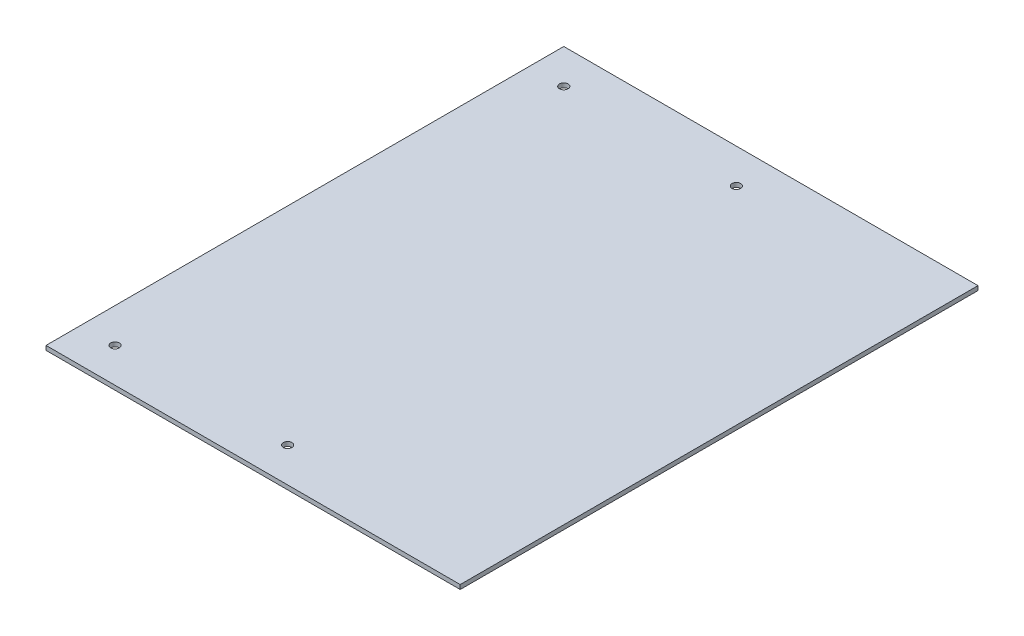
ISO-10303-21;
HEADER;
FILE_DESCRIPTION(('STEP AP214'),'2;1');
FILE_NAME('part.step','',(''),(''),'','','');
FILE_SCHEMA(('AUTOMOTIVE_DESIGN { 1 0 10303 214 1 1 1 1 }'));
ENDSEC;
DATA;
#1=APPLICATION_CONTEXT('core data for automotive mechanical design processes');
#2=APPLICATION_PROTOCOL_DEFINITION('international standard','automotive_design',2000,#1);
#3=PRODUCT_CONTEXT('',#1,'mechanical');
#4=PRODUCT('Part','Part','',(#3));
#5=PRODUCT_RELATED_PRODUCT_CATEGORY('part','',(#4));
#6=PRODUCT_DEFINITION_FORMATION('','',#4);
#7=PRODUCT_DEFINITION_CONTEXT('part definition',#1,'design');
#8=PRODUCT_DEFINITION('design','',#6,#7);
#9=PRODUCT_DEFINITION_SHAPE('','',#8);
#10=(LENGTH_UNIT() NAMED_UNIT(*) SI_UNIT(.MILLI.,.METRE.));
#11=(NAMED_UNIT(*) PLANE_ANGLE_UNIT() SI_UNIT($,.RADIAN.));
#12=(NAMED_UNIT(*) SI_UNIT($,.STERADIAN.) SOLID_ANGLE_UNIT());
#13=UNCERTAINTY_MEASURE_WITH_UNIT(LENGTH_MEASURE(1.E-05),#10,'distance_accuracy_value','');
#14=(GEOMETRIC_REPRESENTATION_CONTEXT(3) GLOBAL_UNCERTAINTY_ASSIGNED_CONTEXT((#13)) GLOBAL_UNIT_ASSIGNED_CONTEXT((#10,
#11,#12)) REPRESENTATION_CONTEXT('',''));
#15=CARTESIAN_POINT('',(0.,0.,0.));
#16=DIRECTION('',(0.,0.,1.));
#17=DIRECTION('',(1.,0.,0.));
#18=AXIS2_PLACEMENT_3D('',#15,#16,#17);
#19=CARTESIAN_POINT('',(0.,1.5875,0.));
#20=DIRECTION('',(0.,1.,0.));
#21=DIRECTION('',(0.,0.,1.));
#22=AXIS2_PLACEMENT_3D('',#19,#20,#21);
#23=PLANE('',#22);
#24=CARTESIAN_POINT('',(0.,1.5875,-82.55));
#25=DIRECTION('',(0.,1.,0.));
#26=DIRECTION('',(0.,0.,-1.));
#27=AXIS2_PLACEMENT_3D('',#24,#25,#26);
#28=CIRCLE('',#27,1.5875);
#29=CARTESIAN_POINT('',(0.,1.5875,-84.1375));
#30=VERTEX_POINT('',#29);
#31=EDGE_CURVE('E121',#30,#30,#28,.T.);
#32=ORIENTED_EDGE('',*,*,#31,.F.);
#33=EDGE_LOOP('',(#32));
#34=FACE_BOUND('',#33,.T.);
#35=CARTESIAN_POINT('',(-63.5,1.5875,82.55));
#36=DIRECTION('',(0.,1.,0.));
#37=DIRECTION('',(0.,0.,1.));
#38=AXIS2_PLACEMENT_3D('',#35,#36,#37);
#39=CIRCLE('',#38,1.5875);
#40=CARTESIAN_POINT('',(-63.5,1.5875,84.1375));
#41=VERTEX_POINT('',#40);
#42=EDGE_CURVE('E100',#41,#41,#39,.T.);
#43=ORIENTED_EDGE('',*,*,#42,.F.);
#44=EDGE_LOOP('',(#43));
#45=FACE_BOUND('',#44,.T.);
#46=DIRECTION('',(0.,0.,1.));
#47=VECTOR('',#46,1.);
#48=CARTESIAN_POINT('',(-76.2,1.5875,95.25));
#49=LINE('',#48,#47);
#50=CARTESIAN_POINT('',(-76.2,1.5875,-95.25));
#51=VERTEX_POINT('',#50);
#52=CARTESIAN_POINT('',(-76.2,1.5875,95.25));
#53=VERTEX_POINT('',#52);
#54=EDGE_CURVE('E85',#51,#53,#49,.T.);
#55=ORIENTED_EDGE('',*,*,#54,.T.);
#56=DIRECTION('',(1.,0.,0.));
#57=VECTOR('',#56,1.);
#58=CARTESIAN_POINT('',(76.2,1.5875,95.25));
#59=LINE('',#58,#57);
#60=CARTESIAN_POINT('',(76.2,1.5875,95.25));
#61=VERTEX_POINT('',#60);
#62=EDGE_CURVE('E80',#53,#61,#59,.T.);
#63=ORIENTED_EDGE('',*,*,#62,.T.);
#64=DIRECTION('',(0.,0.,-1.));
#65=VECTOR('',#64,1.);
#66=CARTESIAN_POINT('',(76.2,1.5875,95.25));
#67=LINE('',#66,#65);
#68=CARTESIAN_POINT('',(76.2,1.5875,-95.25));
#69=VERTEX_POINT('',#68);
#70=EDGE_CURVE('E83',#61,#69,#67,.T.);
#71=ORIENTED_EDGE('',*,*,#70,.T.);
#72=DIRECTION('',(-1.,0.,0.));
#73=VECTOR('',#72,1.);
#74=CARTESIAN_POINT('',(76.2,1.5875,-95.25));
#75=LINE('',#74,#73);
#76=EDGE_CURVE('E50',#69,#51,#75,.T.);
#77=ORIENTED_EDGE('',*,*,#76,.T.);
#78=EDGE_LOOP('',(#55,#63,#71,#77));
#79=FACE_BOUND('',#78,.T.);
#80=CARTESIAN_POINT('',(0.,1.5875,82.55));
#81=DIRECTION('',(0.,1.,0.));
#82=DIRECTION('',(0.,0.,1.));
#83=AXIS2_PLACEMENT_3D('',#80,#81,#82);
#84=CIRCLE('',#83,1.5875);
#85=CARTESIAN_POINT('',(0.,1.5875,84.1375));
#86=VERTEX_POINT('',#85);
#87=EDGE_CURVE('E115',#86,#86,#84,.T.);
#88=ORIENTED_EDGE('',*,*,#87,.F.);
#89=EDGE_LOOP('',(#88));
#90=FACE_BOUND('',#89,.T.);
#91=CARTESIAN_POINT('',(-63.5,1.5875,-82.55));
#92=DIRECTION('',(0.,1.,0.));
#93=DIRECTION('',(0.,0.,-1.));
#94=AXIS2_PLACEMENT_3D('',#91,#92,#93);
#95=CIRCLE('',#94,1.5875);
#96=CARTESIAN_POINT('',(-63.5,1.5875,-84.1374999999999));
#97=VERTEX_POINT('',#96);
#98=EDGE_CURVE('E127',#97,#97,#95,.T.);
#99=ORIENTED_EDGE('',*,*,#98,.F.);
#100=EDGE_LOOP('',(#99));
#101=FACE_BOUND('',#100,.T.);
#102=ADVANCED_FACE('F33',(#34,#45,#79,#90,#101),#23,.T.);
#103=CARTESIAN_POINT('',(0.,0.,0.));
#104=DIRECTION('',(0.,1.,0.));
#105=DIRECTION('',(0.,0.,1.));
#106=AXIS2_PLACEMENT_3D('',#103,#104,#105);
#107=PLANE('',#106);
#108=DIRECTION('',(0.,0.,1.));
#109=VECTOR('',#108,1.);
#110=CARTESIAN_POINT('',(-76.2,0.,95.25));
#111=LINE('',#110,#109);
#112=CARTESIAN_POINT('',(-76.2,0.,-95.25));
#113=VERTEX_POINT('',#112);
#114=CARTESIAN_POINT('',(-76.2,0.,95.25));
#115=VERTEX_POINT('',#114);
#116=EDGE_CURVE('E97',#113,#115,#111,.T.);
#117=ORIENTED_EDGE('',*,*,#116,.F.);
#118=DIRECTION('',(-1.,0.,0.));
#119=VECTOR('',#118,1.);
#120=CARTESIAN_POINT('',(76.2,0.,-95.25));
#121=LINE('',#120,#119);
#122=CARTESIAN_POINT('',(76.2,0.,-95.25));
#123=VERTEX_POINT('',#122);
#124=EDGE_CURVE('E73',#123,#113,#121,.T.);
#125=ORIENTED_EDGE('',*,*,#124,.F.);
#126=DIRECTION('',(0.,0.,-1.));
#127=VECTOR('',#126,1.);
#128=CARTESIAN_POINT('',(76.2,0.,95.25));
#129=LINE('',#128,#127);
#130=CARTESIAN_POINT('',(76.2,0.,95.25));
#131=VERTEX_POINT('',#130);
#132=EDGE_CURVE('E67',#131,#123,#129,.T.);
#133=ORIENTED_EDGE('',*,*,#132,.F.);
#134=DIRECTION('',(1.,0.,0.));
#135=VECTOR('',#134,1.);
#136=CARTESIAN_POINT('',(76.2,0.,95.25));
#137=LINE('',#136,#135);
#138=EDGE_CURVE('E89',#115,#131,#137,.T.);
#139=ORIENTED_EDGE('',*,*,#138,.F.);
#140=EDGE_LOOP('',(#117,#125,#133,#139));
#141=FACE_BOUND('',#140,.T.);
#142=CARTESIAN_POINT('',(-63.5,0.,82.55));
#143=DIRECTION('',(0.,1.,0.));
#144=DIRECTION('',(0.,0.,1.));
#145=AXIS2_PLACEMENT_3D('',#142,#143,#144);
#146=CIRCLE('',#145,1.5875);
#147=CARTESIAN_POINT('',(-63.5,0.,84.1375));
#148=VERTEX_POINT('',#147);
#149=EDGE_CURVE('E112',#148,#148,#146,.T.);
#150=ORIENTED_EDGE('',*,*,#149,.T.);
#151=EDGE_LOOP('',(#150));
#152=FACE_BOUND('',#151,.T.);
#153=CARTESIAN_POINT('',(0.,0.,82.55));
#154=DIRECTION('',(0.,1.,0.));
#155=DIRECTION('',(0.,0.,1.));
#156=AXIS2_PLACEMENT_3D('',#153,#154,#155);
#157=CIRCLE('',#156,1.5875);
#158=CARTESIAN_POINT('',(0.,0.,84.1375));
#159=VERTEX_POINT('',#158);
#160=EDGE_CURVE('E118',#159,#159,#157,.T.);
#161=ORIENTED_EDGE('',*,*,#160,.T.);
#162=EDGE_LOOP('',(#161));
#163=FACE_BOUND('',#162,.T.);
#164=CARTESIAN_POINT('',(0.,0.,-82.55));
#165=DIRECTION('',(0.,1.,0.));
#166=DIRECTION('',(0.,0.,-1.));
#167=AXIS2_PLACEMENT_3D('',#164,#165,#166);
#168=CIRCLE('',#167,1.5875);
#169=CARTESIAN_POINT('',(0.,0.,-84.1375));
#170=VERTEX_POINT('',#169);
#171=EDGE_CURVE('E124',#170,#170,#168,.T.);
#172=ORIENTED_EDGE('',*,*,#171,.T.);
#173=EDGE_LOOP('',(#172));
#174=FACE_BOUND('',#173,.T.);
#175=CARTESIAN_POINT('',(-63.5,0.,-82.55));
#176=DIRECTION('',(0.,1.,0.));
#177=DIRECTION('',(0.,0.,-1.));
#178=AXIS2_PLACEMENT_3D('',#175,#176,#177);
#179=CIRCLE('',#178,1.5875);
#180=CARTESIAN_POINT('',(-63.5,0.,-84.1374999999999));
#181=VERTEX_POINT('',#180);
#182=EDGE_CURVE('E130',#181,#181,#179,.T.);
#183=ORIENTED_EDGE('',*,*,#182,.T.);
#184=EDGE_LOOP('',(#183));
#185=FACE_BOUND('',#184,.T.);
#186=ADVANCED_FACE('F108',(#141,#152,#163,#174,#185),#107,.F.);
#187=CARTESIAN_POINT('',(-76.2,1.5875,95.25));
#188=DIRECTION('',(1.,0.,0.));
#189=DIRECTION('',(0.,0.,-1.));
#190=AXIS2_PLACEMENT_3D('',#187,#188,#189);
#191=PLANE('',#190);
#192=ORIENTED_EDGE('',*,*,#116,.T.);
#193=DIRECTION('',(0.,-1.,0.));
#194=VECTOR('',#193,1.);
#195=CARTESIAN_POINT('',(-76.2,1.5875,95.25));
#196=LINE('',#195,#194);
#197=EDGE_CURVE('E11',#53,#115,#196,.T.);
#198=ORIENTED_EDGE('',*,*,#197,.F.);
#199=ORIENTED_EDGE('',*,*,#54,.F.);
#200=DIRECTION('',(0.,-1.,0.));
#201=VECTOR('',#200,1.);
#202=CARTESIAN_POINT('',(-76.2,1.5875,-95.25));
#203=LINE('',#202,#201);
#204=EDGE_CURVE('E93',#51,#113,#203,.T.);
#205=ORIENTED_EDGE('',*,*,#204,.T.);
#206=EDGE_LOOP('',(#192,#198,#199,#205));
#207=FACE_BOUND('',#206,.T.);
#208=ADVANCED_FACE('F35',(#207),#191,.F.);
#209=CARTESIAN_POINT('',(76.2,1.5875,95.25));
#210=DIRECTION('',(0.,0.,-1.));
#211=DIRECTION('',(-1.,0.,0.));
#212=AXIS2_PLACEMENT_3D('',#209,#210,#211);
#213=PLANE('',#212);
#214=ORIENTED_EDGE('',*,*,#138,.T.);
#215=DIRECTION('',(0.,-1.,0.));
#216=VECTOR('',#215,1.);
#217=CARTESIAN_POINT('',(76.2,1.5875,95.25));
#218=LINE('',#217,#216);
#219=EDGE_CURVE('E42',#61,#131,#218,.T.);
#220=ORIENTED_EDGE('',*,*,#219,.F.);
#221=ORIENTED_EDGE('',*,*,#62,.F.);
#222=ORIENTED_EDGE('',*,*,#197,.T.);
#223=EDGE_LOOP('',(#214,#220,#221,#222));
#224=FACE_BOUND('',#223,.T.);
#225=ADVANCED_FACE('F88',(#224),#213,.F.);
#226=CARTESIAN_POINT('',(76.2,1.5875,95.25));
#227=DIRECTION('',(-1.,0.,0.));
#228=DIRECTION('',(0.,0.,1.));
#229=AXIS2_PLACEMENT_3D('',#226,#227,#228);
#230=PLANE('',#229);
#231=ORIENTED_EDGE('',*,*,#132,.T.);
#232=DIRECTION('',(0.,-1.,0.));
#233=VECTOR('',#232,1.);
#234=CARTESIAN_POINT('',(76.2,1.5875,-95.25));
#235=LINE('',#234,#233);
#236=EDGE_CURVE('E90',#69,#123,#235,.T.);
#237=ORIENTED_EDGE('',*,*,#236,.F.);
#238=ORIENTED_EDGE('',*,*,#70,.F.);
#239=ORIENTED_EDGE('',*,*,#219,.T.);
#240=EDGE_LOOP('',(#231,#237,#238,#239));
#241=FACE_BOUND('',#240,.T.);
#242=ADVANCED_FACE('F91',(#241),#230,.F.);
#243=CARTESIAN_POINT('',(76.2,1.5875,-95.25));
#244=DIRECTION('',(0.,0.,1.));
#245=DIRECTION('',(1.,0.,0.));
#246=AXIS2_PLACEMENT_3D('',#243,#244,#245);
#247=PLANE('',#246);
#248=ORIENTED_EDGE('',*,*,#124,.T.);
#249=ORIENTED_EDGE('',*,*,#204,.F.);
#250=ORIENTED_EDGE('',*,*,#76,.F.);
#251=ORIENTED_EDGE('',*,*,#236,.T.);
#252=EDGE_LOOP('',(#248,#249,#250,#251));
#253=FACE_BOUND('',#252,.T.);
#254=ADVANCED_FACE('F105',(#253),#247,.F.);
#255=CARTESIAN_POINT('',(-63.5,1.5875,82.55));
#256=DIRECTION('',(0.,-1.,0.));
#257=DIRECTION('',(0.,0.,-1.));
#258=AXIS2_PLACEMENT_3D('',#255,#256,#257);
#259=CYLINDRICAL_SURFACE('',#258,1.5875);
#260=ORIENTED_EDGE('',*,*,#42,.T.);
#261=EDGE_LOOP('',(#260));
#262=FACE_BOUND('',#261,.T.);
#263=ORIENTED_EDGE('',*,*,#149,.F.);
#264=EDGE_LOOP('',(#263));
#265=FACE_BOUND('',#264,.T.);
#266=ADVANCED_FACE('F149',(#262,#265),#259,.F.);
#267=CARTESIAN_POINT('',(0.,1.5875,82.55));
#268=DIRECTION('',(0.,-1.,0.));
#269=DIRECTION('',(0.,0.,-1.));
#270=AXIS2_PLACEMENT_3D('',#267,#268,#269);
#271=CYLINDRICAL_SURFACE('',#270,1.5875);
#272=ORIENTED_EDGE('',*,*,#87,.T.);
#273=EDGE_LOOP('',(#272));
#274=FACE_BOUND('',#273,.T.);
#275=ORIENTED_EDGE('',*,*,#160,.F.);
#276=EDGE_LOOP('',(#275));
#277=FACE_BOUND('',#276,.T.);
#278=ADVANCED_FACE('F195',(#274,#277),#271,.F.);
#279=CARTESIAN_POINT('',(0.,1.5875,-82.55));
#280=DIRECTION('',(0.,-1.,0.));
#281=DIRECTION('',(0.,0.,-1.));
#282=AXIS2_PLACEMENT_3D('',#279,#280,#281);
#283=CYLINDRICAL_SURFACE('',#282,1.5875);
#284=ORIENTED_EDGE('',*,*,#31,.T.);
#285=EDGE_LOOP('',(#284));
#286=FACE_BOUND('',#285,.T.);
#287=ORIENTED_EDGE('',*,*,#171,.F.);
#288=EDGE_LOOP('',(#287));
#289=FACE_BOUND('',#288,.T.);
#290=ADVANCED_FACE('F203',(#286,#289),#283,.F.);
#291=CARTESIAN_POINT('',(-63.5,1.5875,-82.55));
#292=DIRECTION('',(0.,-1.,0.));
#293=DIRECTION('',(0.,0.,-1.));
#294=AXIS2_PLACEMENT_3D('',#291,#292,#293);
#295=CYLINDRICAL_SURFACE('',#294,1.5875);
#296=ORIENTED_EDGE('',*,*,#98,.T.);
#297=EDGE_LOOP('',(#296));
#298=FACE_BOUND('',#297,.T.);
#299=ORIENTED_EDGE('',*,*,#182,.F.);
#300=EDGE_LOOP('',(#299));
#301=FACE_BOUND('',#300,.T.);
#302=ADVANCED_FACE('F136',(#298,#301),#295,.F.);
#303=CLOSED_SHELL('',(#102,#186,#208,#225,#242,#254,#266,#278,#290,#302));
#304=MANIFOLD_SOLID_BREP('B2',#303);
#305=ADVANCED_BREP_SHAPE_REPRESENTATION('',(#18,#304),#14);
#306=SHAPE_DEFINITION_REPRESENTATION(#9,#305);
ENDSEC;
END-ISO-10303-21;
